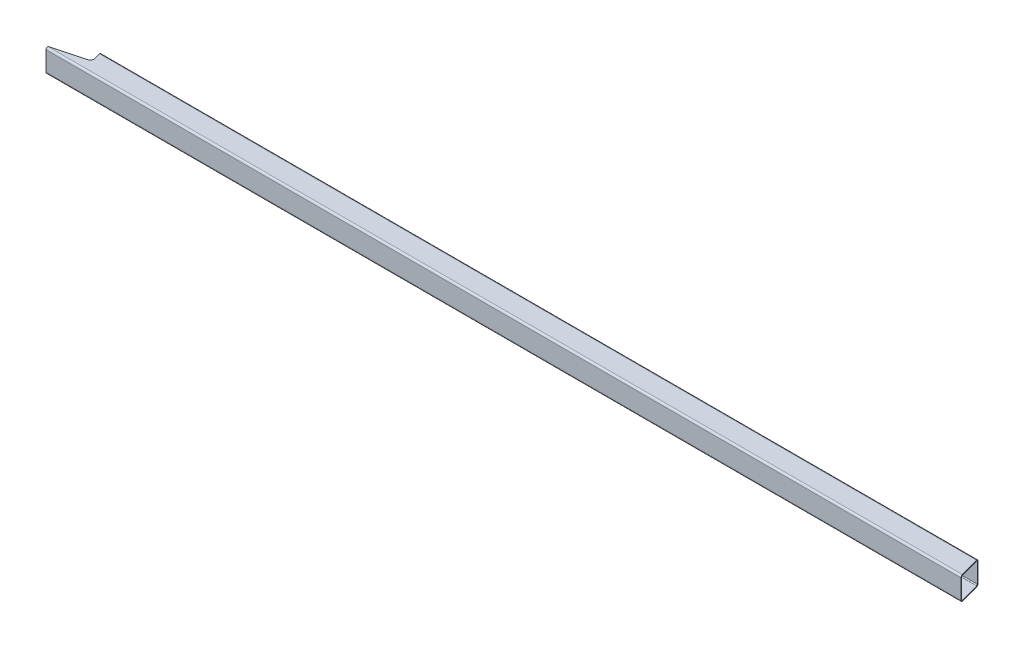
from build123d import *

# Parameters (mm, degrees)
BOSS_EXTRUDE1_DEPTH     = 3048
CUT_EXTRUDE1_DEPTH      = 3049.476212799
CUT_EXTRUDE1_DEPTH_BACK = 3049.476212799
CUT_EXTRUDE2_DEPTH      = 3049.476212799
CUT_EXTRUDE2_DEPTH_BACK = 3049.476212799


with BuildPart() as part:
    # sk 3x3x0.12 → Boss-Extrude1 (new body)
    with BuildSketch(Plane.YZ):
        with BuildLine():
            Line((-32.004, -38.1), (32.004, -38.1))
            ThreePointArc((32.004, -38.1), (36.314522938, -36.314522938), (38.1, -32.004))
            Line((38.1, -32.004), (38.1, 32.004))
            ThreePointArc((38.1, 32.004), (36.314522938, 36.314522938), (32.004, 38.1))
            Line((32.004, 38.1), (-32.004, 38.1))
            ThreePointArc((-32.004, 38.1), (-36.314522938, 36.314522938), (-38.1, 32.004))
            Line((-38.1, 32.004), (-38.1, -32.004))
            ThreePointArc((-38.1, -32.004), (-36.314522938, -36.314522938), (-32.004, -38.1))
        make_face()
        with BuildLine():
            Line((35.052, 32.004), (35.052, -32.004))
            ThreePointArc((35.052, -32.004), (34.159261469, -34.159261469), (32.004, -35.052))
            Line((32.004, -35.052), (-32.004, -35.052))
            ThreePointArc((-32.004, -35.052), (-34.159261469, -34.159261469), (-35.052, -32.004))
            Line((-35.052, -32.004), (-35.052, 32.004))
            ThreePointArc((-35.052, 32.004), (-34.159261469, 34.159261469), (-32.004, 35.052))
            Line((-32.004, 35.052), (32.004, 35.052))
            ThreePointArc((32.004, 35.052), (34.159261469, 34.159261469), (35.052, 32.004))
        make_face(mode=Mode.SUBTRACT)
    extrude(amount=BOSS_EXTRUDE1_DEPTH)

    # Sketch5 → Cut-Extrude1 (cut, two sides: drawn at the far end of the back side and taken through both)
    with BuildSketch(Plane(origin=(0, 0, 0), x_dir=(-1, 0, 0), z_dir=(0, 1, 0)).offset(-CUT_EXTRUDE1_DEPTH_BACK)):
        with BuildLine():
            Line((-87.577504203, -102.110827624), (-111.952628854, -11.141623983))
            ThreePointArc((-111.952628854, -11.141623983), (-110.683893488, -1.50462211), (-102.972372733, 4.412635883))
            Line((-102.972372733, 4.412635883), (20.328058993, 37.450886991))
            Line((20.328058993, 37.450886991), (20.328058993, -73.197619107))
            Line((20.328058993, -73.197619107), (-87.577504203, -102.110827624))
        make_face()
    extrude(amount=CUT_EXTRUDE1_DEPTH + CUT_EXTRUDE1_DEPTH_BACK, mode=Mode.SUBTRACT)

    # Sketch6 → Cut-Extrude2 (cut, two sides: drawn at the far end of the back side and taken through both)
    with BuildSketch(Plane(origin=(0, 0, 0), x_dir=(-1, 0, 0), z_dir=(0, 1, 0)).offset(-CUT_EXTRUDE2_DEPTH_BACK)):
        Polygon((-3031.898181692, 106.198185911), (-3077.048421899, 106.198185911), (-3077.048421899, -83.867994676), (-2980.970102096, -83.867994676), align=None)
    extrude(amount=CUT_EXTRUDE2_DEPTH + CUT_EXTRUDE2_DEPTH_BACK, mode=Mode.SUBTRACT)


solid = part.part
